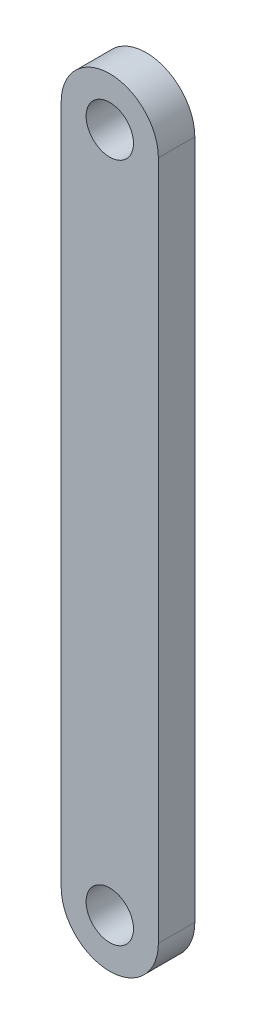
from build123d import *

# Parameters (mm, degrees)
EXTRUDE_1_DEPTH         = 3
HOLE_WIZARD_3_9_3_9_2_D = 3.9


with BuildPart() as part:
    # Sketch 1 → Extrude 1 (new body)
    with BuildSketch(Plane.XY):
        with BuildLine():
            Line((-4, 0), (-4, 56))
            ThreePointArc((-4, 56), (0, 60), (4, 56))
            Line((4, 56), (4, 0))
            ThreePointArc((4, 0), (0, -4), (-4, 0))
        make_face()
    extrude(amount=EXTRUDE_1_DEPTH)

    # Hole Wizard 3.9 _3.9_ _2 (through all)
    with Locations(Plane.XY.offset(3)):
        with Locations((0, 56), (0, 0)):
            Hole(HOLE_WIZARD_3_9_3_9_2_D / 2)


solid = part.part
